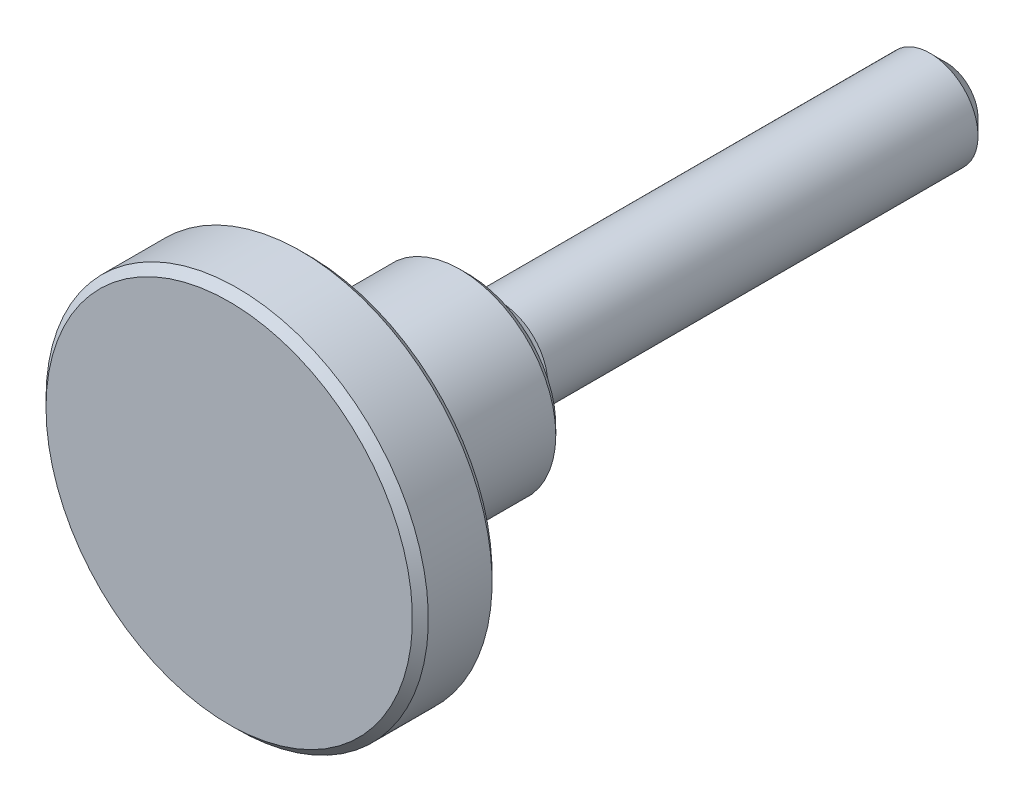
ISO-10303-21;
HEADER;
FILE_DESCRIPTION(('STEP AP214'),'2;1');
FILE_NAME('part.step','',(''),(''),'','','');
FILE_SCHEMA(('AUTOMOTIVE_DESIGN { 1 0 10303 214 1 1 1 1 }'));
ENDSEC;
DATA;
#1=APPLICATION_CONTEXT('core data for automotive mechanical design processes');
#2=APPLICATION_PROTOCOL_DEFINITION('international standard','automotive_design',2000,#1);
#3=PRODUCT_CONTEXT('',#1,'mechanical');
#4=PRODUCT('Part','Part','',(#3));
#5=PRODUCT_RELATED_PRODUCT_CATEGORY('part','',(#4));
#6=PRODUCT_DEFINITION_FORMATION('','',#4);
#7=PRODUCT_DEFINITION_CONTEXT('part definition',#1,'design');
#8=PRODUCT_DEFINITION('design','',#6,#7);
#9=PRODUCT_DEFINITION_SHAPE('','',#8);
#10=(LENGTH_UNIT() NAMED_UNIT(*) SI_UNIT(.MILLI.,.METRE.));
#11=(NAMED_UNIT(*) PLANE_ANGLE_UNIT() SI_UNIT($,.RADIAN.));
#12=(NAMED_UNIT(*) SI_UNIT($,.STERADIAN.) SOLID_ANGLE_UNIT());
#13=UNCERTAINTY_MEASURE_WITH_UNIT(LENGTH_MEASURE(1.E-05),#10,'distance_accuracy_value','');
#14=(GEOMETRIC_REPRESENTATION_CONTEXT(3) GLOBAL_UNCERTAINTY_ASSIGNED_CONTEXT((#13)) GLOBAL_UNIT_ASSIGNED_CONTEXT((#10,
#11,#12)) REPRESENTATION_CONTEXT('',''));
#15=CARTESIAN_POINT('',(0.,0.,0.));
#16=DIRECTION('',(0.,0.,1.));
#17=DIRECTION('',(1.,0.,0.));
#18=AXIS2_PLACEMENT_3D('',#15,#16,#17);
#19=CARTESIAN_POINT('',(0.,2.,-30.));
#20=DIRECTION('',(0.,0.,-1.));
#21=DIRECTION('',(-1.,0.,0.));
#22=AXIS2_PLACEMENT_3D('',#19,#20,#21);
#23=PLANE('',#22);
#24=CARTESIAN_POINT('',(0.,0.,-30.));
#25=DIRECTION('',(0.,0.,-1.));
#26=DIRECTION('',(-1.,0.,0.));
#27=AXIS2_PLACEMENT_3D('',#24,#25,#26);
#28=CIRCLE('',#27,2.);
#29=CARTESIAN_POINT('',(-2.,0.,-30.));
#30=VERTEX_POINT('',#29);
#31=EDGE_CURVE('E8',#30,#30,#28,.T.);
#32=ORIENTED_EDGE('',*,*,#31,.T.);
#33=EDGE_LOOP('',(#32));
#34=FACE_BOUND('',#33,.T.);
#35=ADVANCED_FACE('F12',(#34),#23,.T.);
#36=CARTESIAN_POINT('',(0.,0.,-30.));
#37=DIRECTION('',(0.,0.,1.));
#38=DIRECTION('',(1.,0.,0.));
#39=AXIS2_PLACEMENT_3D('',#36,#37,#38);
#40=CONICAL_SURFACE('',#39,2.,0.785398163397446);
#41=CARTESIAN_POINT('',(0.,0.,-29.));
#42=DIRECTION('',(0.,0.,-1.));
#43=DIRECTION('',(-1.,0.,0.));
#44=AXIS2_PLACEMENT_3D('',#41,#42,#43);
#45=CIRCLE('',#44,3.);
#46=CARTESIAN_POINT('',(-3.,0.,-29.));
#47=VERTEX_POINT('',#46);
#48=EDGE_CURVE('E18',#47,#47,#45,.T.);
#49=ORIENTED_EDGE('',*,*,#48,.T.);
#50=EDGE_LOOP('',(#49));
#51=FACE_BOUND('',#50,.T.);
#52=ORIENTED_EDGE('',*,*,#31,.F.);
#53=EDGE_LOOP('',(#52));
#54=FACE_BOUND('',#53,.T.);
#55=ADVANCED_FACE('F79',(#51,#54),#40,.T.);
#56=CARTESIAN_POINT('',(0.,0.,-32.5));
#57=DIRECTION('',(0.,0.,-1.));
#58=DIRECTION('',(-1.,0.,0.));
#59=AXIS2_PLACEMENT_3D('',#56,#57,#58);
#60=CYLINDRICAL_SURFACE('',#59,3.);
#61=CARTESIAN_POINT('',(0.,0.,-2.));
#62=DIRECTION('',(0.,0.,-1.));
#63=DIRECTION('',(-1.,0.,0.));
#64=AXIS2_PLACEMENT_3D('',#61,#62,#63);
#65=CIRCLE('',#64,3.);
#66=CARTESIAN_POINT('',(-3.,0.,-2.));
#67=VERTEX_POINT('',#66);
#68=EDGE_CURVE('E22',#67,#67,#65,.T.);
#69=ORIENTED_EDGE('',*,*,#68,.T.);
#70=EDGE_LOOP('',(#69));
#71=FACE_BOUND('',#70,.T.);
#72=ORIENTED_EDGE('',*,*,#48,.F.);
#73=EDGE_LOOP('',(#72));
#74=FACE_BOUND('',#73,.T.);
#75=ADVANCED_FACE('F84',(#71,#74),#60,.T.);
#76=CARTESIAN_POINT('',(0.,3.,-2.));
#77=DIRECTION('',(0.,0.,1.));
#78=DIRECTION('',(1.,0.,0.));
#79=AXIS2_PLACEMENT_3D('',#76,#77,#78);
#80=PLANE('',#79);
#81=CARTESIAN_POINT('',(0.,0.,-2.));
#82=DIRECTION('',(0.,0.,-1.));
#83=DIRECTION('',(-1.,0.,0.));
#84=AXIS2_PLACEMENT_3D('',#81,#82,#83);
#85=CIRCLE('',#84,2.7);
#86=CARTESIAN_POINT('',(-2.7,0.,-2.));
#87=VERTEX_POINT('',#86);
#88=EDGE_CURVE('E26',#87,#87,#85,.T.);
#89=ORIENTED_EDGE('',*,*,#88,.T.);
#90=EDGE_LOOP('',(#89));
#91=FACE_BOUND('',#90,.T.);
#92=ORIENTED_EDGE('',*,*,#68,.F.);
#93=EDGE_LOOP('',(#92));
#94=FACE_BOUND('',#93,.T.);
#95=ADVANCED_FACE('F89',(#91,#94),#80,.T.);
#96=CARTESIAN_POINT('',(0.,0.,-1.5));
#97=DIRECTION('',(0.,0.,-1.));
#98=DIRECTION('',(-1.,0.,0.));
#99=AXIS2_PLACEMENT_3D('',#96,#97,#98);
#100=TOROIDAL_SURFACE('',#99,2.7,0.5);
#101=CARTESIAN_POINT('',(0.,0.,-1.5));
#102=DIRECTION('',(0.,0.,-1.));
#103=DIRECTION('',(-1.,0.,0.));
#104=AXIS2_PLACEMENT_3D('',#101,#102,#103);
#105=CIRCLE('',#104,2.2);
#106=CARTESIAN_POINT('',(-2.2,0.,-1.5));
#107=VERTEX_POINT('',#106);
#108=EDGE_CURVE('E31',#107,#107,#105,.T.);
#109=ORIENTED_EDGE('',*,*,#108,.T.);
#110=EDGE_LOOP('',(#109));
#111=FACE_BOUND('',#110,.T.);
#112=ORIENTED_EDGE('',*,*,#88,.F.);
#113=EDGE_LOOP('',(#112));
#114=FACE_BOUND('',#113,.T.);
#115=ADVANCED_FACE('F96',(#111,#114),#100,.F.);
#116=CARTESIAN_POINT('',(0.,0.,-32.5));
#117=DIRECTION('',(0.,0.,-1.));
#118=DIRECTION('',(-1.,0.,0.));
#119=AXIS2_PLACEMENT_3D('',#116,#117,#118);
#120=CYLINDRICAL_SURFACE('',#119,2.2);
#121=CARTESIAN_POINT('',(0.,0.,-0.5));
#122=DIRECTION('',(0.,0.,-1.));
#123=DIRECTION('',(-1.,0.,0.));
#124=AXIS2_PLACEMENT_3D('',#121,#122,#123);
#125=CIRCLE('',#124,2.2);
#126=CARTESIAN_POINT('',(-2.2,0.,-0.5));
#127=VERTEX_POINT('',#126);
#128=EDGE_CURVE('E34',#127,#127,#125,.T.);
#129=ORIENTED_EDGE('',*,*,#128,.T.);
#130=EDGE_LOOP('',(#129));
#131=FACE_BOUND('',#130,.T.);
#132=ORIENTED_EDGE('',*,*,#108,.F.);
#133=EDGE_LOOP('',(#132));
#134=FACE_BOUND('',#133,.T.);
#135=ADVANCED_FACE('F100',(#131,#134),#120,.T.);
#136=CARTESIAN_POINT('',(0.,0.,-0.5));
#137=DIRECTION('',(0.,0.,-1.));
#138=DIRECTION('',(-1.,0.,0.));
#139=AXIS2_PLACEMENT_3D('',#136,#137,#138);
#140=TOROIDAL_SURFACE('',#139,2.7,0.5);
#141=CARTESIAN_POINT('',(0.,0.,0.));
#142=DIRECTION('',(0.,0.,-1.));
#143=DIRECTION('',(-1.,0.,0.));
#144=AXIS2_PLACEMENT_3D('',#141,#142,#143);
#145=CIRCLE('',#144,2.7);
#146=CARTESIAN_POINT('',(-2.7,0.,0.));
#147=VERTEX_POINT('',#146);
#148=EDGE_CURVE('E37',#147,#147,#145,.T.);
#149=ORIENTED_EDGE('',*,*,#148,.T.);
#150=EDGE_LOOP('',(#149));
#151=FACE_BOUND('',#150,.T.);
#152=ORIENTED_EDGE('',*,*,#128,.F.);
#153=EDGE_LOOP('',(#152));
#154=FACE_BOUND('',#153,.T.);
#155=ADVANCED_FACE('F104',(#151,#154),#140,.F.);
#156=CARTESIAN_POINT('',(0.,5.5,0.));
#157=DIRECTION('',(0.,0.,-1.));
#158=DIRECTION('',(-1.,0.,0.));
#159=AXIS2_PLACEMENT_3D('',#156,#157,#158);
#160=PLANE('',#159);
#161=CARTESIAN_POINT('',(0.,0.,0.));
#162=DIRECTION('',(0.,0.,-1.));
#163=DIRECTION('',(-1.,0.,0.));
#164=AXIS2_PLACEMENT_3D('',#161,#162,#163);
#165=CIRCLE('',#164,5.5);
#166=CARTESIAN_POINT('',(-5.5,0.,0.));
#167=VERTEX_POINT('',#166);
#168=EDGE_CURVE('E40',#167,#167,#165,.T.);
#169=ORIENTED_EDGE('',*,*,#168,.T.);
#170=EDGE_LOOP('',(#169));
#171=FACE_BOUND('',#170,.T.);
#172=ORIENTED_EDGE('',*,*,#148,.F.);
#173=EDGE_LOOP('',(#172));
#174=FACE_BOUND('',#173,.T.);
#175=ADVANCED_FACE('F108',(#171,#174),#160,.T.);
#176=CARTESIAN_POINT('',(0.,0.,0.));
#177=DIRECTION('',(0.,0.,1.));
#178=DIRECTION('',(1.,0.,0.));
#179=AXIS2_PLACEMENT_3D('',#176,#177,#178);
#180=CONICAL_SURFACE('',#179,5.5,0.785398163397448);
#181=CARTESIAN_POINT('',(0.,0.,0.5));
#182=DIRECTION('',(0.,0.,-1.));
#183=DIRECTION('',(-1.,0.,0.));
#184=AXIS2_PLACEMENT_3D('',#181,#182,#183);
#185=CIRCLE('',#184,6.);
#186=CARTESIAN_POINT('',(-6.,0.,0.5));
#187=VERTEX_POINT('',#186);
#188=EDGE_CURVE('E43',#187,#187,#185,.T.);
#189=ORIENTED_EDGE('',*,*,#188,.T.);
#190=EDGE_LOOP('',(#189));
#191=FACE_BOUND('',#190,.T.);
#192=ORIENTED_EDGE('',*,*,#168,.F.);
#193=EDGE_LOOP('',(#192));
#194=FACE_BOUND('',#193,.T.);
#195=ADVANCED_FACE('F112',(#191,#194),#180,.T.);
#196=CARTESIAN_POINT('',(0.,0.,-32.5));
#197=DIRECTION('',(0.,0.,-1.));
#198=DIRECTION('',(-1.,0.,0.));
#199=AXIS2_PLACEMENT_3D('',#196,#197,#198);
#200=CYLINDRICAL_SURFACE('',#199,6.);
#201=CARTESIAN_POINT('',(0.,0.,9.));
#202=DIRECTION('',(0.,0.,-1.));
#203=DIRECTION('',(-1.,0.,0.));
#204=AXIS2_PLACEMENT_3D('',#201,#202,#203);
#205=CIRCLE('',#204,6.);
#206=CARTESIAN_POINT('',(-6.,0.,9.));
#207=VERTEX_POINT('',#206);
#208=EDGE_CURVE('E46',#207,#207,#205,.T.);
#209=ORIENTED_EDGE('',*,*,#208,.T.);
#210=EDGE_LOOP('',(#209));
#211=FACE_BOUND('',#210,.T.);
#212=ORIENTED_EDGE('',*,*,#188,.F.);
#213=EDGE_LOOP('',(#212));
#214=FACE_BOUND('',#213,.T.);
#215=ADVANCED_FACE('F116',(#211,#214),#200,.T.);
#216=CARTESIAN_POINT('',(0.,0.,9.));
#217=DIRECTION('',(0.,0.,-1.));
#218=DIRECTION('',(-1.,0.,0.));
#219=AXIS2_PLACEMENT_3D('',#216,#217,#218);
#220=TOROIDAL_SURFACE('',#219,7.,1.);
#221=CARTESIAN_POINT('',(0.,0.,10.));
#222=DIRECTION('',(0.,0.,-1.));
#223=DIRECTION('',(-1.,0.,0.));
#224=AXIS2_PLACEMENT_3D('',#221,#222,#223);
#225=CIRCLE('',#224,7.);
#226=CARTESIAN_POINT('',(-7.,0.,10.));
#227=VERTEX_POINT('',#226);
#228=EDGE_CURVE('E49',#227,#227,#225,.T.);
#229=ORIENTED_EDGE('',*,*,#228,.T.);
#230=EDGE_LOOP('',(#229));
#231=FACE_BOUND('',#230,.T.);
#232=ORIENTED_EDGE('',*,*,#208,.F.);
#233=EDGE_LOOP('',(#232));
#234=FACE_BOUND('',#233,.T.);
#235=ADVANCED_FACE('F120',(#231,#234),#220,.F.);
#236=CARTESIAN_POINT('',(0.,11.5,10.));
#237=DIRECTION('',(0.,0.,-1.));
#238=DIRECTION('',(-1.,0.,0.));
#239=AXIS2_PLACEMENT_3D('',#236,#237,#238);
#240=PLANE('',#239);
#241=CARTESIAN_POINT('',(0.,0.,10.));
#242=DIRECTION('',(0.,0.,-1.));
#243=DIRECTION('',(-1.,0.,0.));
#244=AXIS2_PLACEMENT_3D('',#241,#242,#243);
#245=CIRCLE('',#244,11.5);
#246=CARTESIAN_POINT('',(-11.5,0.,10.));
#247=VERTEX_POINT('',#246);
#248=EDGE_CURVE('E52',#247,#247,#245,.T.);
#249=ORIENTED_EDGE('',*,*,#248,.T.);
#250=EDGE_LOOP('',(#249));
#251=FACE_BOUND('',#250,.T.);
#252=ORIENTED_EDGE('',*,*,#228,.F.);
#253=EDGE_LOOP('',(#252));
#254=FACE_BOUND('',#253,.T.);
#255=ADVANCED_FACE('F124',(#251,#254),#240,.T.);
#256=CARTESIAN_POINT('',(0.,0.,10.));
#257=DIRECTION('',(0.,0.,1.));
#258=DIRECTION('',(1.,0.,0.));
#259=AXIS2_PLACEMENT_3D('',#256,#257,#258);
#260=CONICAL_SURFACE('',#259,11.5,0.785398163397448);
#261=CARTESIAN_POINT('',(0.,0.,10.5));
#262=DIRECTION('',(0.,0.,-1.));
#263=DIRECTION('',(-1.,0.,0.));
#264=AXIS2_PLACEMENT_3D('',#261,#262,#263);
#265=CIRCLE('',#264,12.);
#266=CARTESIAN_POINT('',(-12.,0.,10.5));
#267=VERTEX_POINT('',#266);
#268=EDGE_CURVE('E55',#267,#267,#265,.T.);
#269=ORIENTED_EDGE('',*,*,#268,.T.);
#270=EDGE_LOOP('',(#269));
#271=FACE_BOUND('',#270,.T.);
#272=ORIENTED_EDGE('',*,*,#248,.F.);
#273=EDGE_LOOP('',(#272));
#274=FACE_BOUND('',#273,.T.);
#275=ADVANCED_FACE('F128',(#271,#274),#260,.T.);
#276=CARTESIAN_POINT('',(0.,0.,-32.5));
#277=DIRECTION('',(0.,0.,-1.));
#278=DIRECTION('',(-1.,0.,0.));
#279=AXIS2_PLACEMENT_3D('',#276,#277,#278);
#280=CYLINDRICAL_SURFACE('',#279,12.);
#281=CARTESIAN_POINT('',(0.,0.,14.5));
#282=DIRECTION('',(0.,0.,-1.));
#283=DIRECTION('',(-1.,0.,0.));
#284=AXIS2_PLACEMENT_3D('',#281,#282,#283);
#285=CIRCLE('',#284,12.);
#286=CARTESIAN_POINT('',(-12.,0.,14.5));
#287=VERTEX_POINT('',#286);
#288=EDGE_CURVE('E58',#287,#287,#285,.T.);
#289=ORIENTED_EDGE('',*,*,#288,.T.);
#290=EDGE_LOOP('',(#289));
#291=FACE_BOUND('',#290,.T.);
#292=ORIENTED_EDGE('',*,*,#268,.F.);
#293=EDGE_LOOP('',(#292));
#294=FACE_BOUND('',#293,.T.);
#295=ADVANCED_FACE('F76',(#291,#294),#280,.T.);
#296=CARTESIAN_POINT('',(0.,0.,14.5));
#297=DIRECTION('',(0.,0.,-1.));
#298=DIRECTION('',(-1.,0.,0.));
#299=AXIS2_PLACEMENT_3D('',#296,#297,#298);
#300=CONICAL_SURFACE('',#299,12.,0.785398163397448);
#301=CARTESIAN_POINT('',(0.,0.,15.));
#302=DIRECTION('',(0.,0.,-1.));
#303=DIRECTION('',(-1.,0.,0.));
#304=AXIS2_PLACEMENT_3D('',#301,#302,#303);
#305=CIRCLE('',#304,11.5);
#306=CARTESIAN_POINT('',(-11.5,0.,15.));
#307=VERTEX_POINT('',#306);
#308=EDGE_CURVE('E61',#307,#307,#305,.T.);
#309=ORIENTED_EDGE('',*,*,#308,.T.);
#310=EDGE_LOOP('',(#309));
#311=FACE_BOUND('',#310,.T.);
#312=ORIENTED_EDGE('',*,*,#288,.F.);
#313=EDGE_LOOP('',(#312));
#314=FACE_BOUND('',#313,.T.);
#315=ADVANCED_FACE('F65',(#311,#314),#300,.T.);
#316=CARTESIAN_POINT('',(0.,11.5,15.));
#317=DIRECTION('',(0.,0.,1.));
#318=DIRECTION('',(1.,0.,0.));
#319=AXIS2_PLACEMENT_3D('',#316,#317,#318);
#320=PLANE('',#319);
#321=ORIENTED_EDGE('',*,*,#308,.F.);
#322=EDGE_LOOP('',(#321));
#323=FACE_BOUND('',#322,.T.);
#324=ADVANCED_FACE('F68',(#323),#320,.T.);
#325=CLOSED_SHELL('',(#35,#55,#75,#95,#115,#135,#155,#175,#195,#215,#235,#255,#275,#295,#315,#324));
#326=MANIFOLD_SOLID_BREP('B1',#325);
#327=ADVANCED_BREP_SHAPE_REPRESENTATION('',(#18,#326),#14);
#328=SHAPE_DEFINITION_REPRESENTATION(#9,#327);
ENDSEC;
END-ISO-10303-21;
